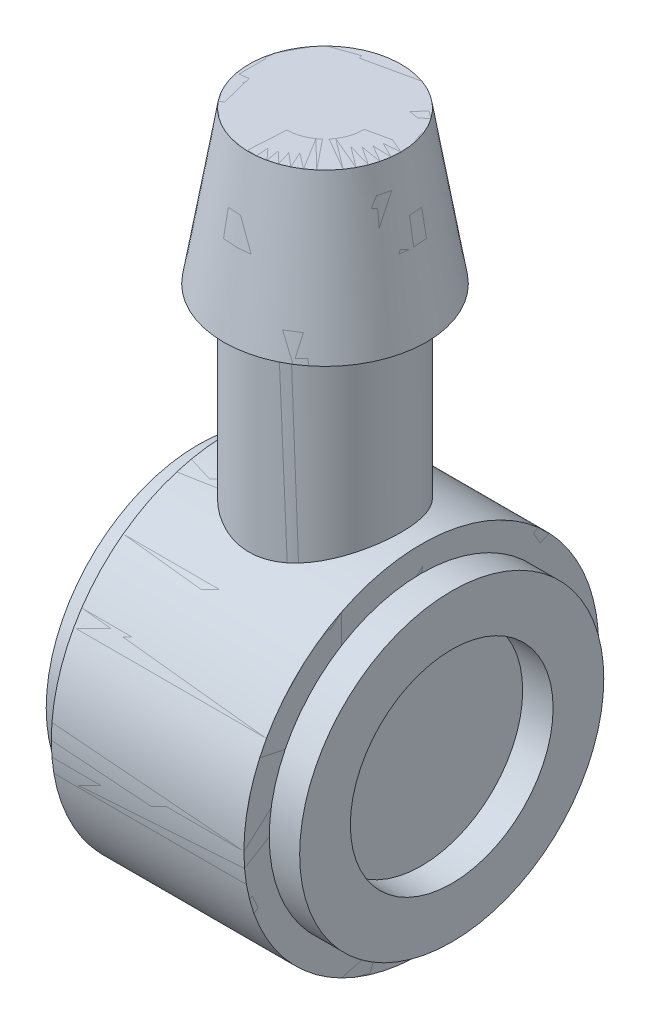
ISO-10303-21;
HEADER;
FILE_DESCRIPTION(('STEP AP214'),'2;1');
FILE_NAME('part.step','',(''),(''),'','','');
FILE_SCHEMA(('AUTOMOTIVE_DESIGN { 1 0 10303 214 1 1 1 1 }'));
ENDSEC;
DATA;
#1=APPLICATION_CONTEXT('core data for automotive mechanical design processes');
#2=APPLICATION_PROTOCOL_DEFINITION('international standard','automotive_design',2000,#1);
#3=PRODUCT_CONTEXT('',#1,'mechanical');
#4=PRODUCT('Part','Part','',(#3));
#5=PRODUCT_RELATED_PRODUCT_CATEGORY('part','',(#4));
#6=PRODUCT_DEFINITION_FORMATION('','',#4);
#7=PRODUCT_DEFINITION_CONTEXT('part definition',#1,'design');
#8=PRODUCT_DEFINITION('design','',#6,#7);
#9=PRODUCT_DEFINITION_SHAPE('','',#8);
#10=(LENGTH_UNIT() NAMED_UNIT(*) SI_UNIT(.MILLI.,.METRE.));
#11=(NAMED_UNIT(*) PLANE_ANGLE_UNIT() SI_UNIT($,.RADIAN.));
#12=(NAMED_UNIT(*) SI_UNIT($,.STERADIAN.) SOLID_ANGLE_UNIT());
#13=UNCERTAINTY_MEASURE_WITH_UNIT(LENGTH_MEASURE(1.E-05),#10,'distance_accuracy_value','');
#14=(GEOMETRIC_REPRESENTATION_CONTEXT(3) GLOBAL_UNCERTAINTY_ASSIGNED_CONTEXT((#13)) GLOBAL_UNIT_ASSIGNED_CONTEXT((#10,
#11,#12)) REPRESENTATION_CONTEXT('',''));
#15=CARTESIAN_POINT('',(0.,0.,0.));
#16=DIRECTION('',(0.,0.,1.));
#17=DIRECTION('',(1.,0.,0.));
#18=AXIS2_PLACEMENT_3D('',#15,#16,#17);
#19=CARTESIAN_POINT('',(-1.9,-4.888807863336,0.77431109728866));
#20=DIRECTION('',(-1.,0.,0.));
#21=DIRECTION('',(0.,0.809016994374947,0.587785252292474));
#22=AXIS2_PLACEMENT_3D('',#19,#20,#21);
#23=PLANE('',#22);
#24=CARTESIAN_POINT('',(-1.9,0.,0.));
#25=DIRECTION('',(-1.,0.,0.));
#26=DIRECTION('',(0.,0.,1.));
#27=AXIS2_PLACEMENT_3D('',#24,#25,#26);
#28=CIRCLE('',#27,3.50000000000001);
#29=CARTESIAN_POINT('',(-1.9,0.,3.50000000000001));
#30=VERTEX_POINT('',#29);
#31=EDGE_CURVE('P0_E364',#30,#30,#28,.T.);
#32=ORIENTED_EDGE('',*,*,#31,.T.);
#33=EDGE_LOOP('',(#32));
#34=FACE_BOUND('',#33,.T.);
#35=CARTESIAN_POINT('',(-1.9,0.,0.));
#36=DIRECTION('',(-1.,0.,0.));
#37=DIRECTION('',(0.,0.,1.));
#38=AXIS2_PLACEMENT_3D('',#35,#36,#37);
#39=CIRCLE('',#38,2.99999999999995);
#40=CARTESIAN_POINT('',(-1.9,0.,2.99999999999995));
#41=VERTEX_POINT('',#40);
#42=EDGE_CURVE('P0_E470',#41,#41,#39,.T.);
#43=ORIENTED_EDGE('',*,*,#42,.F.);
#44=EDGE_LOOP('',(#43));
#45=FACE_BOUND('',#44,.T.);
#46=ADVANCED_FACE('P0_F348',(#34,#45),#23,.T.);
#47=CARTESIAN_POINT('',(1.9,-0.77431109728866,-4.888807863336));
#48=DIRECTION('',(1.,0.,0.));
#49=DIRECTION('',(0.,0.809016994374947,0.587785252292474));
#50=AXIS2_PLACEMENT_3D('',#47,#48,#49);
#51=PLANE('',#50);
#52=CARTESIAN_POINT('',(1.9,0.,0.));
#53=DIRECTION('',(-1.,0.,0.));
#54=DIRECTION('',(0.,0.,1.));
#55=AXIS2_PLACEMENT_3D('',#52,#53,#54);
#56=CIRCLE('',#55,3.50000000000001);
#57=CARTESIAN_POINT('',(1.9,0.,3.50000000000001));
#58=VERTEX_POINT('',#57);
#59=EDGE_CURVE('P0_E359',#58,#58,#56,.F.);
#60=ORIENTED_EDGE('',*,*,#59,.T.);
#61=EDGE_LOOP('',(#60));
#62=FACE_BOUND('',#61,.T.);
#63=CARTESIAN_POINT('',(1.9,0.,0.));
#64=DIRECTION('',(1.,0.,0.));
#65=DIRECTION('',(0.,0.,-1.));
#66=AXIS2_PLACEMENT_3D('',#63,#64,#65);
#67=CIRCLE('',#66,2.99999999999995);
#68=CARTESIAN_POINT('',(1.9,0.,-2.99999999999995));
#69=VERTEX_POINT('',#68);
#70=EDGE_CURVE('P0_E458',#69,#69,#67,.T.);
#71=ORIENTED_EDGE('',*,*,#70,.F.);
#72=EDGE_LOOP('',(#71));
#73=FACE_BOUND('',#72,.T.);
#74=ADVANCED_FACE('P0_F350',(#62,#73),#51,.T.);
#75=CARTESIAN_POINT('',(1.5,10.,1.5));
#76=DIRECTION('',(0.,1.,0.));
#77=DIRECTION('',(0.,0.,-1.));
#78=AXIS2_PLACEMENT_3D('',#75,#76,#77);
#79=PLANE('',#78);
#80=CARTESIAN_POINT('',(0.,10.,0.));
#81=DIRECTION('',(0.,1.,0.));
#82=DIRECTION('',(0.,0.,1.));
#83=AXIS2_PLACEMENT_3D('',#80,#81,#82);
#84=CIRCLE('',#83,0.75);
#85=CARTESIAN_POINT('',(0.,10.,0.75));
#86=VERTEX_POINT('',#85);
#87=EDGE_CURVE('P0_E445',#86,#86,#84,.T.);
#88=ORIENTED_EDGE('',*,*,#87,.F.);
#89=EDGE_LOOP('',(#88));
#90=FACE_BOUND('',#89,.T.);
#91=CARTESIAN_POINT('',(0.,10.,0.));
#92=DIRECTION('',(0.,-1.,0.));
#93=DIRECTION('',(1.,0.,0.));
#94=AXIS2_PLACEMENT_3D('',#91,#92,#93);
#95=CIRCLE('',#94,1.5);
#96=CARTESIAN_POINT('',(1.5,10.,0.));
#97=VERTEX_POINT('',#96);
#98=EDGE_CURVE('P0_E448',#97,#97,#95,.F.);
#99=ORIENTED_EDGE('',*,*,#98,.T.);
#100=EDGE_LOOP('',(#99));
#101=FACE_BOUND('',#100,.T.);
#102=ADVANCED_FACE('P0_F402',(#90,#101),#79,.T.);
#103=CARTESIAN_POINT('',(0.,10.,0.));
#104=DIRECTION('',(0.,-1.,0.));
#105=DIRECTION('',(1.,0.,0.));
#106=AXIS2_PLACEMENT_3D('',#103,#104,#105);
#107=CONICAL_SURFACE('',#106,1.5,0.165148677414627);
#108=ORIENTED_EDGE('',*,*,#98,.F.);
#109=EDGE_LOOP('',(#108));
#110=FACE_BOUND('',#109,.T.);
#111=CARTESIAN_POINT('',(0.,7.,0.));
#112=DIRECTION('',(0.,-1.,0.));
#113=DIRECTION('',(1.,0.,0.));
#114=AXIS2_PLACEMENT_3D('',#111,#112,#113);
#115=CIRCLE('',#114,2.);
#116=CARTESIAN_POINT('',(2.,7.,0.));
#117=VERTEX_POINT('',#116);
#118=EDGE_CURVE('P0_E450',#117,#117,#115,.T.);
#119=ORIENTED_EDGE('',*,*,#118,.F.);
#120=EDGE_LOOP('',(#119));
#121=FACE_BOUND('',#120,.T.);
#122=ADVANCED_FACE('P0_F399',(#110,#121),#107,.T.);
#123=CARTESIAN_POINT('',(-2.,7.,2.));
#124=DIRECTION('',(0.,-1.,0.));
#125=DIRECTION('',(0.,0.,-1.));
#126=AXIS2_PLACEMENT_3D('',#123,#124,#125);
#127=PLANE('',#126);
#128=CARTESIAN_POINT('',(0.,7.,0.));
#129=DIRECTION('',(0.,-1.,0.));
#130=DIRECTION('',(1.,0.,0.));
#131=AXIS2_PLACEMENT_3D('',#128,#129,#130);
#132=CIRCLE('',#131,1.5);
#133=CARTESIAN_POINT('',(1.5,7.,0.));
#134=VERTEX_POINT('',#133);
#135=EDGE_CURVE('P0_E388',#134,#134,#132,.F.);
#136=ORIENTED_EDGE('',*,*,#135,.T.);
#137=EDGE_LOOP('',(#136));
#138=FACE_BOUND('',#137,.T.);
#139=ORIENTED_EDGE('',*,*,#118,.T.);
#140=EDGE_LOOP('',(#139));
#141=FACE_BOUND('',#140,.T.);
#142=ADVANCED_FACE('P0_F397',(#138,#141),#127,.T.);
#143=CARTESIAN_POINT('',(0.,7.,0.));
#144=DIRECTION('',(0.,-1.,0.));
#145=DIRECTION('',(1.,0.,0.));
#146=AXIS2_PLACEMENT_3D('',#143,#144,#145);
#147=CYLINDRICAL_SURFACE('',#146,1.5);
#148=ORIENTED_EDGE('',*,*,#135,.F.);
#149=EDGE_LOOP('',(#148));
#150=FACE_BOUND('',#149,.T.);
#151=CARTESIAN_POINT('',(-0.195789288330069,3.1683329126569,-1.48716729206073));
#152=CARTESIAN_POINT('',(-0.2608291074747,3.17235162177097,-1.47860501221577));
#153=CARTESIAN_POINT('',(-0.325181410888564,3.17833785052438,-1.46578159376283));
#154=CARTESIAN_POINT('',(-0.45165434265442,3.19374764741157,-1.43189443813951));
#155=CARTESIAN_POINT('',(-0.513759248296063,3.20319164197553,-1.41078167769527));
#156=CARTESIAN_POINT('',(-0.634687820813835,3.22478863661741,-1.36069257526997));
#157=CARTESIAN_POINT('',(-0.693487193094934,3.23695906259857,-1.3316653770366));
#158=CARTESIAN_POINT('',(-0.806811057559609,3.26310976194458,-1.26623864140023));
#159=CARTESIAN_POINT('',(-0.861311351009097,3.27709924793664,-1.22980100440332));
#160=CARTESIAN_POINT('',(-0.9651081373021,3.30589460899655,-1.15015527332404));
#161=CARTESIAN_POINT('',(-1.01439068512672,3.32070251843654,-1.10692976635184));
#162=CARTESIAN_POINT('',(-1.10690110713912,3.35012043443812,-1.01441912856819));
#163=CARTESIAN_POINT('',(-1.1501326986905,3.3647305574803,-0.965137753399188));
#164=CARTESIAN_POINT('',(-1.22978509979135,3.39278442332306,-0.861331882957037));
#165=CARTESIAN_POINT('',(-1.26622963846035,3.40623213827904,-0.806826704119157));
#166=CARTESIAN_POINT('',(-1.33166459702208,3.43109588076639,-0.693488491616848));
#167=CARTESIAN_POINT('',(-1.36069524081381,3.44252276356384,-0.634681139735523));
#168=CARTESIAN_POINT('',(-1.41078940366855,3.46262945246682,-0.51374083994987));
#169=CARTESIAN_POINT('',(-1.43190065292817,3.47132566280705,-0.451630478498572));
#170=CARTESIAN_POINT('',(-1.46578863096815,3.48544105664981,-0.325155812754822));
#171=CARTESIAN_POINT('',(-1.47860806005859,3.49087701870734,-0.260804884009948));
#172=CARTESIAN_POINT('',(-1.49570111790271,3.49815117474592,-0.130966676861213));
#173=CARTESIAN_POINT('',(-1.5,3.50000000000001,-0.0654833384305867));
#174=CARTESIAN_POINT('',(-1.5,3.50000000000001,0.0654833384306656));
#175=CARTESIAN_POINT('',(-1.49570111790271,3.49815117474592,0.130966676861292));
#176=CARTESIAN_POINT('',(-1.47860806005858,3.49087701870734,0.260804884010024));
#177=CARTESIAN_POINT('',(-1.46578863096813,3.4854410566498,0.325155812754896));
#178=CARTESIAN_POINT('',(-1.43190065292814,3.47132566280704,0.451630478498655));
#179=CARTESIAN_POINT('',(-1.41078940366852,3.46262945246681,0.513740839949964));
#180=CARTESIAN_POINT('',(-1.36069524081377,3.44252276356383,0.634681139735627));
#181=CARTESIAN_POINT('',(-1.33166459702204,3.43109588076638,0.69348849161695));
#182=CARTESIAN_POINT('',(-1.26622963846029,3.40623213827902,0.806826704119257));
#183=CARTESIAN_POINT('',(-1.22978509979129,3.39278442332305,0.861331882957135));
#184=CARTESIAN_POINT('',(-1.15013269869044,3.36473055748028,0.965137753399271));
#185=CARTESIAN_POINT('',(-1.10690110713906,3.3501204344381,1.01441912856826));
#186=CARTESIAN_POINT('',(-1.01439068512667,3.32070251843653,1.10692976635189));
#187=CARTESIAN_POINT('',(-0.965108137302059,3.30589460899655,1.15015527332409));
#188=CARTESIAN_POINT('',(-0.861311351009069,3.27709924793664,1.22980100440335));
#189=CARTESIAN_POINT('',(-0.806811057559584,3.26310976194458,1.26623864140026));
#190=CARTESIAN_POINT('',(-0.693487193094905,3.23695906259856,1.33166537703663));
#191=CARTESIAN_POINT('',(-0.634687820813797,3.22478863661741,1.36069257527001));
#192=CARTESIAN_POINT('',(-0.513759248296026,3.20319164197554,1.41078167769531));
#193=CARTESIAN_POINT('',(-0.451654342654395,3.19374764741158,1.43189443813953));
#194=CARTESIAN_POINT('',(-0.325181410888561,3.17833785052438,1.46578159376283));
#195=CARTESIAN_POINT('',(-0.260829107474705,3.17235162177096,1.47860501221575));
#196=CARTESIAN_POINT('',(-0.13098127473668,3.16432852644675,1.49569905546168));
#197=CARTESIAN_POINT('',(-0.0654906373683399,3.1622776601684,1.50000000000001));
#198=CARTESIAN_POINT('',(0.0654906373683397,3.1622776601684,1.50000000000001));
#199=CARTESIAN_POINT('',(0.13098127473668,3.16432852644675,1.49569905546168));
#200=CARTESIAN_POINT('',(0.260829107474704,3.17235162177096,1.47860501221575));
#201=CARTESIAN_POINT('',(0.325181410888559,3.17833785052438,1.46578159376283));
#202=CARTESIAN_POINT('',(0.451654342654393,3.19374764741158,1.43189443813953));
#203=CARTESIAN_POINT('',(0.513759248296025,3.20319164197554,1.41078167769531));
#204=CARTESIAN_POINT('',(0.634687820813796,3.22478863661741,1.36069257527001));
#205=CARTESIAN_POINT('',(0.693487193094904,3.23695906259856,1.33166537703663));
#206=CARTESIAN_POINT('',(0.806811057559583,3.26310976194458,1.26623864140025));
#207=CARTESIAN_POINT('',(0.861311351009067,3.27709924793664,1.22980100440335));
#208=CARTESIAN_POINT('',(0.965108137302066,3.30589460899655,1.15015527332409));
#209=CARTESIAN_POINT('',(1.01439068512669,3.32070251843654,1.10692976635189));
#210=CARTESIAN_POINT('',(1.10690110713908,3.35012043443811,1.01441912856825));
#211=CARTESIAN_POINT('',(1.15013269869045,3.36473055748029,0.965137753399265));
#212=CARTESIAN_POINT('',(1.22978509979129,3.39278442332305,0.861331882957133));
#213=CARTESIAN_POINT('',(1.26622963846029,3.40623213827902,0.806826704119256));
#214=CARTESIAN_POINT('',(1.33166459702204,3.43109588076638,0.69348849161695));
#215=CARTESIAN_POINT('',(1.36069524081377,3.44252276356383,0.634681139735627));
#216=CARTESIAN_POINT('',(1.41078940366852,3.46262945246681,0.513740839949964));
#217=CARTESIAN_POINT('',(1.43190065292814,3.47132566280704,0.451630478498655));
#218=CARTESIAN_POINT('',(1.46578863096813,3.4854410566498,0.325155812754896));
#219=CARTESIAN_POINT('',(1.47860806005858,3.49087701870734,0.260804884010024));
#220=CARTESIAN_POINT('',(1.4957011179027,3.49815117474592,0.130966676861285));
#221=CARTESIAN_POINT('',(1.5,3.50000000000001,0.0654833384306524));
#222=CARTESIAN_POINT('',(1.5,3.50000000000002,-0.0654833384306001));
#223=CARTESIAN_POINT('',(1.49570111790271,3.49815117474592,-0.13096667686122));
#224=CARTESIAN_POINT('',(1.47860806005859,3.49087701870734,-0.260804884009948));
#225=CARTESIAN_POINT('',(1.46578863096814,3.48544105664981,-0.325155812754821));
#226=CARTESIAN_POINT('',(1.43190065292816,3.47132566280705,-0.451630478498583));
#227=CARTESIAN_POINT('',(1.41078940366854,3.46262945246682,-0.513740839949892));
#228=CARTESIAN_POINT('',(1.3606952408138,3.44252276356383,-0.634681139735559));
#229=CARTESIAN_POINT('',(1.33166459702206,3.43109588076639,-0.693488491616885));
#230=CARTESIAN_POINT('',(1.26622963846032,3.40623213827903,-0.806826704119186));
#231=CARTESIAN_POINT('',(1.22978509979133,3.39278442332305,-0.861331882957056));
#232=CARTESIAN_POINT('',(1.15013269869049,3.36473055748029,-0.965137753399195));
#233=CARTESIAN_POINT('',(1.10690110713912,3.35012043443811,-1.01441912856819));
#234=CARTESIAN_POINT('',(1.01439068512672,3.32070251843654,-1.10692976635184));
#235=CARTESIAN_POINT('',(0.965108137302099,3.30589460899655,-1.15015527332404));
#236=CARTESIAN_POINT('',(0.861311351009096,3.27709924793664,-1.22980100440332));
#237=CARTESIAN_POINT('',(0.806811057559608,3.26310976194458,-1.26623864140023));
#238=CARTESIAN_POINT('',(0.693487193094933,3.23695906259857,-1.3316653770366));
#239=CARTESIAN_POINT('',(0.634687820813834,3.22478863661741,-1.36069257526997));
#240=CARTESIAN_POINT('',(0.513759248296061,3.20319164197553,-1.41078167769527));
#241=CARTESIAN_POINT('',(0.451654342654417,3.19374764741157,-1.43189443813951));
#242=CARTESIAN_POINT('',(0.325181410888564,3.17833785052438,-1.46578159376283));
#243=CARTESIAN_POINT('',(0.260829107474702,3.17235162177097,-1.47860501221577));
#244=CARTESIAN_POINT('',(0.130981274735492,3.16432852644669,-1.49569905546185));
#245=CARTESIAN_POINT('',(0.06549063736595,3.16227766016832,-1.50000000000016));
#246=CARTESIAN_POINT('',(-0.0654906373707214,3.16227766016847,-1.49999999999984));
#247=CARTESIAN_POINT('',(-0.130981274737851,3.16432852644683,-1.49569905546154));
#248=CARTESIAN_POINT('',(-0.195789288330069,3.1683329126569,-1.48716729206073));
#249=B_SPLINE_CURVE_WITH_KNOTS('',3,(#151,#152,#153,#154,#155,#156,#157,#158,#159,#160,#161,
#162,#163,#164,#165,#166,#167,#168,#169,#170,#171,#172,#173,#174,#175,#176,#177,#178,#179,#180,
#181,#182,#183,#184,#185,#186,#187,#188,#189,#190,#191,#192,#193,#194,#195,#196,#197,#198,#199,
#200,#201,#202,#203,#204,#205,#206,#207,#208,#209,#210,#211,#212,#213,#214,#215,#216,#217,#218,
#219,#220,#221,#222,#223,#224,#225,#226,#227,#228,#229,#230,#231,#232,#233,#234,#235,#236,#237,
#238,#239,#240,#241,#242,#243,#244,#245,#246,#247,#248),.UNSPECIFIED.,.T.,.F.,(4,2,2,2,2,2,2,2,
2,2,2,2,2,2,2,2,2,2,2,2,2,2,2,2,2,2,2,2,2,2,2,2,2,2,2,2,2,2,2,2,2,2,2,2,2,2,2,2,4),(0.,
0.197004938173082,0.395192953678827,0.594685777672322,0.795231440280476,0.996300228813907,
1.19724494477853,1.39747335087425,1.59659116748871,1.79448884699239,1.99135912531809,
2.18764503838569,2.38393095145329,2.58080122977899,2.77869890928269,2.97781672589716,
3.17804513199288,3.37898984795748,3.58005863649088,3.78060429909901,3.98009712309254,
4.17828513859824,4.37529007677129,4.57159287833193,4.76789567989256,4.96490061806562,
5.16308863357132,5.36258145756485,5.56312712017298,5.76419590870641,5.96514062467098,
6.16536903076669,6.36448684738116,6.56238452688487,6.75925480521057,6.95554071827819,
7.15182663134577,7.34869690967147,7.54659458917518,7.74571240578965,7.94594081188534,
8.14688552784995,8.34795431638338,8.54849997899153,8.74799280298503,8.94618081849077,
9.14318575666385,9.33948855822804,9.5357913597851),.UNSPECIFIED.);
#250=CARTESIAN_POINT('',(-0.195789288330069,3.1683329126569,-1.48716729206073));
#251=VERTEX_POINT('',#250);
#252=EDGE_CURVE('P0_E372',#251,#251,#249,.T.);
#253=ORIENTED_EDGE('',*,*,#252,.T.);
#254=EDGE_LOOP('',(#253));
#255=FACE_BOUND('',#254,.T.);
#256=ADVANCED_FACE('P0_F393',(#150,#255),#147,.T.);
#257=CARTESIAN_POINT('',(1.9,0.,0.));
#258=DIRECTION('',(-1.,0.,0.));
#259=DIRECTION('',(0.,0.,1.));
#260=AXIS2_PLACEMENT_3D('',#257,#258,#259);
#261=CYLINDRICAL_SURFACE('',#260,3.50000000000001);
#262=ORIENTED_EDGE('',*,*,#59,.F.);
#263=EDGE_LOOP('',(#262));
#264=FACE_BOUND('',#263,.T.);
#265=ORIENTED_EDGE('',*,*,#252,.F.);
#266=EDGE_LOOP('',(#265));
#267=FACE_BOUND('',#266,.T.);
#268=ORIENTED_EDGE('',*,*,#31,.F.);
#269=EDGE_LOOP('',(#268));
#270=FACE_BOUND('',#269,.T.);
#271=ADVANCED_FACE('P0_F390',(#264,#267,#270),#261,.T.);
#272=CARTESIAN_POINT('',(2.5,0.,0.));
#273=DIRECTION('',(-1.,0.,0.));
#274=DIRECTION('',(0.,0.,1.));
#275=AXIS2_PLACEMENT_3D('',#272,#273,#274);
#276=CYLINDRICAL_SURFACE('',#275,2.99999999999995);
#277=CARTESIAN_POINT('',(2.5,0.,0.));
#278=DIRECTION('',(1.,0.,0.));
#279=DIRECTION('',(0.,0.,-1.));
#280=AXIS2_PLACEMENT_3D('',#277,#278,#279);
#281=CIRCLE('',#280,2.99999999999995);
#282=CARTESIAN_POINT('',(2.5,0.,-2.99999999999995));
#283=VERTEX_POINT('',#282);
#284=EDGE_CURVE('P0_E376',#283,#283,#281,.T.);
#285=ORIENTED_EDGE('',*,*,#284,.F.);
#286=EDGE_LOOP('',(#285));
#287=FACE_BOUND('',#286,.T.);
#288=ORIENTED_EDGE('',*,*,#70,.T.);
#289=EDGE_LOOP('',(#288));
#290=FACE_BOUND('',#289,.T.);
#291=ADVANCED_FACE('P0_F404',(#287,#290),#276,.T.);
#292=CARTESIAN_POINT('',(2.5,0.,0.));
#293=DIRECTION('',(1.,0.,0.));
#294=DIRECTION('',(0.,0.,-1.));
#295=AXIS2_PLACEMENT_3D('',#292,#293,#294);
#296=PLANE('',#295);
#297=CARTESIAN_POINT('',(2.5,0.,0.));
#298=DIRECTION('',(1.,0.,0.));
#299=DIRECTION('',(0.,0.,-1.));
#300=AXIS2_PLACEMENT_3D('',#297,#298,#299);
#301=CIRCLE('',#300,1.99999999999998);
#302=CARTESIAN_POINT('',(2.5,0.,-1.99999999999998));
#303=VERTEX_POINT('',#302);
#304=EDGE_CURVE('P0_E478',#303,#303,#301,.T.);
#305=ORIENTED_EDGE('',*,*,#304,.F.);
#306=EDGE_LOOP('',(#305));
#307=FACE_BOUND('',#306,.T.);
#308=ORIENTED_EDGE('',*,*,#284,.T.);
#309=EDGE_LOOP('',(#308));
#310=FACE_BOUND('',#309,.T.);
#311=ADVANCED_FACE('P0_F407',(#307,#310),#296,.T.);
#312=CARTESIAN_POINT('',(-2.5,0.,0.));
#313=DIRECTION('',(1.,0.,0.));
#314=DIRECTION('',(0.,0.,-1.));
#315=AXIS2_PLACEMENT_3D('',#312,#313,#314);
#316=CYLINDRICAL_SURFACE('',#315,2.99999999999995);
#317=CARTESIAN_POINT('',(-2.5,0.,0.));
#318=DIRECTION('',(-1.,0.,0.));
#319=DIRECTION('',(0.,0.,1.));
#320=AXIS2_PLACEMENT_3D('',#317,#318,#319);
#321=CIRCLE('',#320,2.99999999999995);
#322=CARTESIAN_POINT('',(-2.5,0.,2.99999999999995));
#323=VERTEX_POINT('',#322);
#324=EDGE_CURVE('P0_E466',#323,#323,#321,.T.);
#325=ORIENTED_EDGE('',*,*,#324,.F.);
#326=EDGE_LOOP('',(#325));
#327=FACE_BOUND('',#326,.T.);
#328=ORIENTED_EDGE('',*,*,#42,.T.);
#329=EDGE_LOOP('',(#328));
#330=FACE_BOUND('',#329,.T.);
#331=ADVANCED_FACE('P0_F411',(#327,#330),#316,.T.);
#332=CARTESIAN_POINT('',(-2.5,0.,0.));
#333=DIRECTION('',(-1.,0.,0.));
#334=DIRECTION('',(0.,0.,1.));
#335=AXIS2_PLACEMENT_3D('',#332,#333,#334);
#336=PLANE('',#335);
#337=CARTESIAN_POINT('',(-2.5,0.,0.));
#338=DIRECTION('',(1.,0.,0.));
#339=DIRECTION('',(0.,0.,-1.));
#340=AXIS2_PLACEMENT_3D('',#337,#338,#339);
#341=CIRCLE('',#340,1.99999999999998);
#342=CARTESIAN_POINT('',(-2.5,0.,-1.99999999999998));
#343=VERTEX_POINT('',#342);
#344=EDGE_CURVE('P0_E475',#343,#343,#341,.T.);
#345=ORIENTED_EDGE('',*,*,#344,.T.);
#346=EDGE_LOOP('',(#345));
#347=FACE_BOUND('',#346,.T.);
#348=ORIENTED_EDGE('',*,*,#324,.T.);
#349=EDGE_LOOP('',(#348));
#350=FACE_BOUND('',#349,.T.);
#351=ADVANCED_FACE('P0_F415',(#347,#350),#336,.T.);
#352=CARTESIAN_POINT('',(-2.5,0.,0.));
#353=DIRECTION('',(1.,0.,0.));
#354=DIRECTION('',(0.,0.,-1.));
#355=AXIS2_PLACEMENT_3D('',#352,#353,#354);
#356=CYLINDRICAL_SURFACE('',#355,1.99999999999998);
#357=CARTESIAN_POINT('',(0.,1.85404962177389,0.75));
#358=CARTESIAN_POINT('',(0.0405037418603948,1.85404820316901,0.750001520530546));
#359=CARTESIAN_POINT('',(0.0809974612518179,1.8553913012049,0.746707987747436));
#360=CARTESIAN_POINT('',(0.160764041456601,1.86058079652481,0.733680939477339));
#361=CARTESIAN_POINT('',(0.200036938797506,1.86442711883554,0.723947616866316));
#362=CARTESIAN_POINT('',(0.276187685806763,1.87412740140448,0.698448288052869));
#363=CARTESIAN_POINT('',(0.313071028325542,1.87997654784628,0.682696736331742));
#364=CARTESIAN_POINT('',(0.38368594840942,1.89301567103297,0.645659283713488));
#365=CARTESIAN_POINT('',(0.41741657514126,1.90020605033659,0.624371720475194));
#366=CARTESIAN_POINT('',(0.482445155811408,1.91551787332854,0.575733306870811));
#367=CARTESIAN_POINT('',(0.513564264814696,1.92366670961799,0.548151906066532));
#368=CARTESIAN_POINT('',(0.570861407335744,1.93974875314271,0.488197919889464));
#369=CARTESIAN_POINT('',(0.597038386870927,1.9476819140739,0.45582431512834));
#370=CARTESIAN_POINT('',(0.644569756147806,1.96276436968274,0.385847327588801));
#371=CARTESIAN_POINT('',(0.665729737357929,1.9698778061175,0.348103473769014));
#372=CARTESIAN_POINT('',(0.701325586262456,1.98219003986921,0.269277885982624));
#373=CARTESIAN_POINT('',(0.715763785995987,1.98738950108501,0.228197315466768));
#374=CARTESIAN_POINT('',(0.736878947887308,1.99509348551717,0.145744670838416));
#375=CARTESIAN_POINT('',(0.743863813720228,1.99770457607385,0.104461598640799));
#376=CARTESIAN_POINT('',(0.750860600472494,2.00032007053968,0.0212321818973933));
#377=CARTESIAN_POINT('',(0.750874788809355,2.00032532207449,-0.0207139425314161));
#378=CARTESIAN_POINT('',(0.744109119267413,1.99779632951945,-0.101871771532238));
#379=CARTESIAN_POINT('',(0.737665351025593,1.99538770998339,-0.14111608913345));
#380=CARTESIAN_POINT('',(0.718732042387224,1.98846637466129,-0.217919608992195));
#381=CARTESIAN_POINT('',(0.706242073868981,1.98395350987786,-0.255478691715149));
#382=CARTESIAN_POINT('',(0.675414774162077,1.97318884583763,-0.328494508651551));
#383=CARTESIAN_POINT('',(0.656994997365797,1.96691269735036,-0.363912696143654));
#384=CARTESIAN_POINT('',(0.614903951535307,1.95325655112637,-0.431243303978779));
#385=CARTESIAN_POINT('',(0.5912309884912,1.94587619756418,-0.463154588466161));
#386=CARTESIAN_POINT('',(0.537686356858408,1.93026264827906,-0.524545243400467));
#387=CARTESIAN_POINT('',(0.507533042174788,1.92200481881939,-0.55377307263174));
#388=CARTESIAN_POINT('',(0.442703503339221,1.90591230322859,-0.606851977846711));
#389=CARTESIAN_POINT('',(0.408026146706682,1.89807772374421,-0.630701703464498));
#390=CARTESIAN_POINT('',(0.33414026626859,1.88356351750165,-0.672828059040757));
#391=CARTESIAN_POINT('',(0.294848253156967,1.87691338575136,-0.690969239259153));
#392=CARTESIAN_POINT('',(0.213451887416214,1.86586219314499,-0.720282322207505));
#393=CARTESIAN_POINT('',(0.171349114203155,1.86145988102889,-0.731458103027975));
#394=CARTESIAN_POINT('',(0.0880120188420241,1.85569798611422,-0.745950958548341));
#395=CARTESIAN_POINT('',(0.0468579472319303,1.85418392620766,-0.749667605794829));
#396=CARTESIAN_POINT('',(-0.0355046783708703,1.85393269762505,-0.750289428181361));
#397=CARTESIAN_POINT('',(-0.0767132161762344,1.85519483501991,-0.747196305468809));
#398=CARTESIAN_POINT('',(-0.155964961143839,1.86019690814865,-0.734648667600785));
#399=CARTESIAN_POINT('',(-0.194065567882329,1.86381638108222,-0.725503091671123));
#400=CARTESIAN_POINT('',(-0.268173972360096,1.87298243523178,-0.701498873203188));
#401=CARTESIAN_POINT('',(-0.304181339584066,1.87852941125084,-0.686639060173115));
#402=CARTESIAN_POINT('',(-0.374582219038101,1.89118121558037,-0.65100146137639));
#403=CARTESIAN_POINT('',(-0.408864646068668,1.8983366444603,-0.630022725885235));
#404=CARTESIAN_POINT('',(-0.473564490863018,1.91331407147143,-0.582956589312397));
#405=CARTESIAN_POINT('',(-0.503980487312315,1.92113631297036,-0.556867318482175));
#406=CARTESIAN_POINT('',(-0.562084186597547,1.9371652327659,-0.498363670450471));
#407=CARTESIAN_POINT('',(-0.589476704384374,1.94536484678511,-0.465653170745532));
#408=CARTESIAN_POINT('',(-0.638419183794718,1.96074937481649,-0.395898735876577));
#409=CARTESIAN_POINT('',(-0.659969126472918,1.9679342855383,-0.358854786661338));
#410=CARTESIAN_POINT('',(-0.696473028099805,1.98047492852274,-0.28150816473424));
#411=CARTESIAN_POINT('',(-0.711449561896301,1.98583690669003,-0.241217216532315));
#412=CARTESIAN_POINT('',(-0.734328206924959,1.99414718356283,-0.158440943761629));
#413=CARTESIAN_POINT('',(-0.7422336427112,1.99709661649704,-0.115956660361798));
#414=CARTESIAN_POINT('',(-0.750387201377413,2.00014203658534,-0.0326677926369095));
#415=CARTESIAN_POINT('',(-0.751054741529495,2.0003943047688,0.00809038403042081));
#416=CARTESIAN_POINT('',(-0.745792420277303,1.99842444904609,0.08911339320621));
#417=CARTESIAN_POINT('',(-0.739863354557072,1.99620262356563,0.129378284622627));
#418=CARTESIAN_POINT('',(-0.721870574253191,1.98960544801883,0.207274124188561));
#419=CARTESIAN_POINT('',(-0.709960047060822,1.98528395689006,0.244945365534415));
#420=CARTESIAN_POINT('',(-0.680494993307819,1.97493891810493,0.317757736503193));
#421=CARTESIAN_POINT('',(-0.662939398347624,1.96891504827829,0.352898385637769));
#422=CARTESIAN_POINT('',(-0.621843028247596,1.95545309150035,0.421270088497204));
#423=CARTESIAN_POINT('',(-0.598081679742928,1.94796620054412,0.454358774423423));
#424=CARTESIAN_POINT('',(-0.545596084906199,1.9324975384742,0.516208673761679));
#425=CARTESIAN_POINT('',(-0.516870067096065,1.92451559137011,0.544968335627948));
#426=CARTESIAN_POINT('',(-0.453467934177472,1.90844064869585,0.598906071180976));
#427=CARTESIAN_POINT('',(-0.418557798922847,1.90036402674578,0.623814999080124));
#428=CARTESIAN_POINT('',(-0.34479206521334,1.88549162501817,0.667423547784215));
#429=CARTESIAN_POINT('',(-0.305936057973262,1.87869597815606,0.686122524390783));
#430=CARTESIAN_POINT('',(-0.223522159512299,1.86701134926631,0.717329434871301));
#431=CARTESIAN_POINT('',(-0.17983281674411,1.86221901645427,0.729530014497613));
#432=CARTESIAN_POINT('',(-0.0907573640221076,1.85573997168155,0.745861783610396));
#433=CARTESIAN_POINT('',(-0.0453723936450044,1.85405121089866,0.749998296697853));
#434=CARTESIAN_POINT('',(0.,1.85404962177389,0.75));
#435=B_SPLINE_CURVE_WITH_KNOTS('',3,(#357,#358,#359,#360,#361,#362,#363,#364,#365,#366,#367,
#368,#369,#370,#371,#372,#373,#374,#375,#376,#377,#378,#379,#380,#381,#382,#383,#384,#385,#386,
#387,#388,#389,#390,#391,#392,#393,#394,#395,#396,#397,#398,#399,#400,#401,#402,#403,#404,#405,
#406,#407,#408,#409,#410,#411,#412,#413,#414,#415,#416,#417,#418,#419,#420,#421,#422,#423,#424,
#425,#426,#427,#428,#429,#430,#431,#432,#433,#434),.UNSPECIFIED.,.T.,.F.,(4,2,2,2,2,2,2,2,2,2,2,
2,2,2,2,2,2,2,2,2,2,2,2,2,2,2,2,2,2,2,2,2,2,2,2,2,2,2,4),(0.,0.121342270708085,
0.242680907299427,0.363729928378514,0.484815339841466,0.611373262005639,0.737958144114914,
0.868850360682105,0.99969713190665,1.12490009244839,1.25006232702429,1.36903236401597,
1.48801082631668,1.60872065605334,1.72946946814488,1.85728337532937,1.98512933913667,
2.11581296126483,2.24642375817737,2.36982828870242,2.49320197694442,2.61071922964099,
2.72826056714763,2.8502078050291,2.97219974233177,3.10192508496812,3.23165084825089,
3.36092754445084,3.49014342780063,3.61182860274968,3.7334991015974,3.85220137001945,
3.97092611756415,4.09464161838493,4.21840135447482,4.34869299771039,4.47899815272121,
4.61501589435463,4.75094381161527),.UNSPECIFIED.);
#436=CARTESIAN_POINT('',(0.,1.85404962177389,0.75));
#437=VERTEX_POINT('',#436);
#438=EDGE_CURVE('P0_E10',#437,#437,#435,.T.);
#439=ORIENTED_EDGE('',*,*,#438,.T.);
#440=EDGE_LOOP('',(#439));
#441=FACE_BOUND('',#440,.T.);
#442=ORIENTED_EDGE('',*,*,#344,.F.);
#443=EDGE_LOOP('',(#442));
#444=FACE_BOUND('',#443,.T.);
#445=ORIENTED_EDGE('',*,*,#304,.T.);
#446=EDGE_LOOP('',(#445));
#447=FACE_BOUND('',#446,.T.);
#448=ADVANCED_FACE('P0_F418',(#441,#444,#447),#356,.F.);
#449=CARTESIAN_POINT('',(0.,1.85404962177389,0.));
#450=DIRECTION('',(0.,1.,0.));
#451=DIRECTION('',(0.,0.,1.));
#452=AXIS2_PLACEMENT_3D('',#449,#450,#451);
#453=CYLINDRICAL_SURFACE('',#452,0.75);
#454=ORIENTED_EDGE('',*,*,#87,.T.);
#455=EDGE_LOOP('',(#454));
#456=FACE_BOUND('',#455,.T.);
#457=ORIENTED_EDGE('',*,*,#438,.F.);
#458=EDGE_LOOP('',(#457));
#459=FACE_BOUND('',#458,.T.);
#460=ADVANCED_FACE('P0_F422',(#456,#459),#453,.F.);
#461=CLOSED_SHELL('',(#46,#74,#102,#122,#142,#256,#271,#291,#311,#331,#351,#448,#460));
#462=MANIFOLD_SOLID_BREP('P0_B2',#461);
#463=CARTESIAN_POINT('',(1.5,10.,1.5));
#464=DIRECTION('',(0.,1.,0.));
#465=DIRECTION('',(0.,0.,-1.));
#466=AXIS2_PLACEMENT_3D('',#463,#464,#465);
#467=PLANE('',#466);
#468=CARTESIAN_POINT('',(0.,10.,0.));
#469=DIRECTION('',(0.,-1.,0.));
#470=DIRECTION('',(1.,0.,0.));
#471=AXIS2_PLACEMENT_3D('',#468,#469,#470);
#472=CIRCLE('',#471,1.5);
#473=CARTESIAN_POINT('',(1.5,10.,0.));
#474=VERTEX_POINT('',#473);
#475=EDGE_CURVE('P1_E85',#474,#474,#472,.F.);
#476=ORIENTED_EDGE('',*,*,#475,.T.);
#477=EDGE_LOOP('',(#476));
#478=FACE_BOUND('',#477,.T.);
#479=ADVANCED_FACE('P1_F13',(#478),#467,.T.);
#480=CARTESIAN_POINT('',(0.,10.,0.));
#481=DIRECTION('',(0.,-1.,0.));
#482=DIRECTION('',(1.,0.,0.));
#483=AXIS2_PLACEMENT_3D('',#480,#481,#482);
#484=CONICAL_SURFACE('',#483,1.5,0.165148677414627);
#485=ORIENTED_EDGE('',*,*,#475,.F.);
#486=EDGE_LOOP('',(#485));
#487=FACE_BOUND('',#486,.T.);
#488=CARTESIAN_POINT('',(0.,7.,0.));
#489=DIRECTION('',(0.,-1.,0.));
#490=DIRECTION('',(1.,0.,0.));
#491=AXIS2_PLACEMENT_3D('',#488,#489,#490);
#492=CIRCLE('',#491,2.);
#493=CARTESIAN_POINT('',(2.,7.,0.));
#494=VERTEX_POINT('',#493);
#495=EDGE_CURVE('P1_E89',#494,#494,#492,.T.);
#496=ORIENTED_EDGE('',*,*,#495,.F.);
#497=EDGE_LOOP('',(#496));
#498=FACE_BOUND('',#497,.T.);
#499=ADVANCED_FACE('P1_F55',(#487,#498),#484,.T.);
#500=CARTESIAN_POINT('',(-2.,7.,2.));
#501=DIRECTION('',(0.,-1.,0.));
#502=DIRECTION('',(0.,0.,-1.));
#503=AXIS2_PLACEMENT_3D('',#500,#501,#502);
#504=PLANE('',#503);
#505=CARTESIAN_POINT('',(0.,7.,0.));
#506=DIRECTION('',(0.,-1.,0.));
#507=DIRECTION('',(1.,0.,0.));
#508=AXIS2_PLACEMENT_3D('',#505,#506,#507);
#509=CIRCLE('',#508,1.5);
#510=CARTESIAN_POINT('',(1.5,7.,0.));
#511=VERTEX_POINT('',#510);
#512=EDGE_CURVE('P1_E44',#511,#511,#509,.F.);
#513=ORIENTED_EDGE('',*,*,#512,.T.);
#514=EDGE_LOOP('',(#513));
#515=FACE_BOUND('',#514,.T.);
#516=ORIENTED_EDGE('',*,*,#495,.T.);
#517=EDGE_LOOP('',(#516));
#518=FACE_BOUND('',#517,.T.);
#519=ADVANCED_FACE('P1_F53',(#515,#518),#504,.T.);
#520=CARTESIAN_POINT('',(0.,7.,0.));
#521=DIRECTION('',(0.,-1.,0.));
#522=DIRECTION('',(1.,0.,0.));
#523=AXIS2_PLACEMENT_3D('',#520,#521,#522);
#524=CYLINDRICAL_SURFACE('',#523,1.5);
#525=ORIENTED_EDGE('',*,*,#512,.F.);
#526=EDGE_LOOP('',(#525));
#527=FACE_BOUND('',#526,.T.);
#528=CARTESIAN_POINT('',(-0.195789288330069,3.1683329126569,-1.48716729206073));
#529=CARTESIAN_POINT('',(-0.2608291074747,3.17235162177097,-1.47860501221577));
#530=CARTESIAN_POINT('',(-0.325181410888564,3.17833785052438,-1.46578159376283));
#531=CARTESIAN_POINT('',(-0.45165434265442,3.19374764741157,-1.43189443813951));
#532=CARTESIAN_POINT('',(-0.513759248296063,3.20319164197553,-1.41078167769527));
#533=CARTESIAN_POINT('',(-0.634687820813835,3.22478863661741,-1.36069257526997));
#534=CARTESIAN_POINT('',(-0.693487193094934,3.23695906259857,-1.3316653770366));
#535=CARTESIAN_POINT('',(-0.806811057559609,3.26310976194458,-1.26623864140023));
#536=CARTESIAN_POINT('',(-0.861311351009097,3.27709924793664,-1.22980100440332));
#537=CARTESIAN_POINT('',(-0.9651081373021,3.30589460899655,-1.15015527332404));
#538=CARTESIAN_POINT('',(-1.01439068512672,3.32070251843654,-1.10692976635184));
#539=CARTESIAN_POINT('',(-1.10690110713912,3.35012043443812,-1.01441912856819));
#540=CARTESIAN_POINT('',(-1.1501326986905,3.3647305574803,-0.965137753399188));
#541=CARTESIAN_POINT('',(-1.22978509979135,3.39278442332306,-0.861331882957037));
#542=CARTESIAN_POINT('',(-1.26622963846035,3.40623213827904,-0.806826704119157));
#543=CARTESIAN_POINT('',(-1.33166459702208,3.43109588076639,-0.693488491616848));
#544=CARTESIAN_POINT('',(-1.36069524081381,3.44252276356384,-0.634681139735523));
#545=CARTESIAN_POINT('',(-1.41078940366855,3.46262945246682,-0.51374083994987));
#546=CARTESIAN_POINT('',(-1.43190065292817,3.47132566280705,-0.451630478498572));
#547=CARTESIAN_POINT('',(-1.46578863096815,3.48544105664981,-0.325155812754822));
#548=CARTESIAN_POINT('',(-1.47860806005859,3.49087701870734,-0.260804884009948));
#549=CARTESIAN_POINT('',(-1.49570111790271,3.49815117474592,-0.130966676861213));
#550=CARTESIAN_POINT('',(-1.5,3.50000000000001,-0.0654833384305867));
#551=CARTESIAN_POINT('',(-1.5,3.50000000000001,0.0654833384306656));
#552=CARTESIAN_POINT('',(-1.49570111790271,3.49815117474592,0.130966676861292));
#553=CARTESIAN_POINT('',(-1.47860806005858,3.49087701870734,0.260804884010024));
#554=CARTESIAN_POINT('',(-1.46578863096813,3.4854410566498,0.325155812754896));
#555=CARTESIAN_POINT('',(-1.43190065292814,3.47132566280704,0.451630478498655));
#556=CARTESIAN_POINT('',(-1.41078940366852,3.46262945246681,0.513740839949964));
#557=CARTESIAN_POINT('',(-1.36069524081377,3.44252276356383,0.634681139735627));
#558=CARTESIAN_POINT('',(-1.33166459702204,3.43109588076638,0.69348849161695));
#559=CARTESIAN_POINT('',(-1.26622963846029,3.40623213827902,0.806826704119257));
#560=CARTESIAN_POINT('',(-1.22978509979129,3.39278442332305,0.861331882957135));
#561=CARTESIAN_POINT('',(-1.15013269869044,3.36473055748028,0.965137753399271));
#562=CARTESIAN_POINT('',(-1.10690110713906,3.3501204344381,1.01441912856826));
#563=CARTESIAN_POINT('',(-1.01439068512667,3.32070251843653,1.10692976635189));
#564=CARTESIAN_POINT('',(-0.965108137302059,3.30589460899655,1.15015527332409));
#565=CARTESIAN_POINT('',(-0.861311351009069,3.27709924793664,1.22980100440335));
#566=CARTESIAN_POINT('',(-0.806811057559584,3.26310976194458,1.26623864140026));
#567=CARTESIAN_POINT('',(-0.693487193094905,3.23695906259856,1.33166537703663));
#568=CARTESIAN_POINT('',(-0.634687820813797,3.22478863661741,1.36069257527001));
#569=CARTESIAN_POINT('',(-0.513759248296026,3.20319164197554,1.41078167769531));
#570=CARTESIAN_POINT('',(-0.451654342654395,3.19374764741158,1.43189443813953));
#571=CARTESIAN_POINT('',(-0.325181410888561,3.17833785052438,1.46578159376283));
#572=CARTESIAN_POINT('',(-0.260829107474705,3.17235162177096,1.47860501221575));
#573=CARTESIAN_POINT('',(-0.13098127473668,3.16432852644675,1.49569905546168));
#574=CARTESIAN_POINT('',(-0.0654906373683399,3.1622776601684,1.50000000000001));
#575=CARTESIAN_POINT('',(0.0654906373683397,3.1622776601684,1.50000000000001));
#576=CARTESIAN_POINT('',(0.13098127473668,3.16432852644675,1.49569905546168));
#577=CARTESIAN_POINT('',(0.260829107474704,3.17235162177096,1.47860501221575));
#578=CARTESIAN_POINT('',(0.325181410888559,3.17833785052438,1.46578159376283));
#579=CARTESIAN_POINT('',(0.451654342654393,3.19374764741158,1.43189443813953));
#580=CARTESIAN_POINT('',(0.513759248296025,3.20319164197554,1.41078167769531));
#581=CARTESIAN_POINT('',(0.634687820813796,3.22478863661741,1.36069257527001));
#582=CARTESIAN_POINT('',(0.693487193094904,3.23695906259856,1.33166537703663));
#583=CARTESIAN_POINT('',(0.806811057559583,3.26310976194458,1.26623864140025));
#584=CARTESIAN_POINT('',(0.861311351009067,3.27709924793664,1.22980100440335));
#585=CARTESIAN_POINT('',(0.965108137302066,3.30589460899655,1.15015527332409));
#586=CARTESIAN_POINT('',(1.01439068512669,3.32070251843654,1.10692976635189));
#587=CARTESIAN_POINT('',(1.10690110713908,3.35012043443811,1.01441912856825));
#588=CARTESIAN_POINT('',(1.15013269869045,3.36473055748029,0.965137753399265));
#589=CARTESIAN_POINT('',(1.22978509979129,3.39278442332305,0.861331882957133));
#590=CARTESIAN_POINT('',(1.26622963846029,3.40623213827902,0.806826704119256));
#591=CARTESIAN_POINT('',(1.33166459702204,3.43109588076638,0.69348849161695));
#592=CARTESIAN_POINT('',(1.36069524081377,3.44252276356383,0.634681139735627));
#593=CARTESIAN_POINT('',(1.41078940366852,3.46262945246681,0.513740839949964));
#594=CARTESIAN_POINT('',(1.43190065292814,3.47132566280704,0.451630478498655));
#595=CARTESIAN_POINT('',(1.46578863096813,3.4854410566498,0.325155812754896));
#596=CARTESIAN_POINT('',(1.47860806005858,3.49087701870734,0.260804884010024));
#597=CARTESIAN_POINT('',(1.4957011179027,3.49815117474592,0.130966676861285));
#598=CARTESIAN_POINT('',(1.5,3.50000000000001,0.0654833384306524));
#599=CARTESIAN_POINT('',(1.5,3.50000000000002,-0.0654833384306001));
#600=CARTESIAN_POINT('',(1.49570111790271,3.49815117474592,-0.13096667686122));
#601=CARTESIAN_POINT('',(1.47860806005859,3.49087701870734,-0.260804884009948));
#602=CARTESIAN_POINT('',(1.46578863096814,3.48544105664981,-0.325155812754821));
#603=CARTESIAN_POINT('',(1.43190065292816,3.47132566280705,-0.451630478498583));
#604=CARTESIAN_POINT('',(1.41078940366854,3.46262945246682,-0.513740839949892));
#605=CARTESIAN_POINT('',(1.3606952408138,3.44252276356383,-0.634681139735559));
#606=CARTESIAN_POINT('',(1.33166459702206,3.43109588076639,-0.693488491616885));
#607=CARTESIAN_POINT('',(1.26622963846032,3.40623213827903,-0.806826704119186));
#608=CARTESIAN_POINT('',(1.22978509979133,3.39278442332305,-0.861331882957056));
#609=CARTESIAN_POINT('',(1.15013269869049,3.36473055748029,-0.965137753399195));
#610=CARTESIAN_POINT('',(1.10690110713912,3.35012043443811,-1.01441912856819));
#611=CARTESIAN_POINT('',(1.01439068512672,3.32070251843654,-1.10692976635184));
#612=CARTESIAN_POINT('',(0.965108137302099,3.30589460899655,-1.15015527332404));
#613=CARTESIAN_POINT('',(0.861311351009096,3.27709924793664,-1.22980100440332));
#614=CARTESIAN_POINT('',(0.806811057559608,3.26310976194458,-1.26623864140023));
#615=CARTESIAN_POINT('',(0.693487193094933,3.23695906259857,-1.3316653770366));
#616=CARTESIAN_POINT('',(0.634687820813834,3.22478863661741,-1.36069257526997));
#617=CARTESIAN_POINT('',(0.513759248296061,3.20319164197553,-1.41078167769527));
#618=CARTESIAN_POINT('',(0.451654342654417,3.19374764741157,-1.43189443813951));
#619=CARTESIAN_POINT('',(0.325181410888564,3.17833785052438,-1.46578159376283));
#620=CARTESIAN_POINT('',(0.260829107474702,3.17235162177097,-1.47860501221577));
#621=CARTESIAN_POINT('',(0.130981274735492,3.16432852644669,-1.49569905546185));
#622=CARTESIAN_POINT('',(0.06549063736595,3.16227766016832,-1.50000000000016));
#623=CARTESIAN_POINT('',(-0.0654906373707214,3.16227766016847,-1.49999999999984));
#624=CARTESIAN_POINT('',(-0.130981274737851,3.16432852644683,-1.49569905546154));
#625=CARTESIAN_POINT('',(-0.195789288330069,3.1683329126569,-1.48716729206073));
#626=B_SPLINE_CURVE_WITH_KNOTS('',3,(#528,#529,#530,#531,#532,#533,#534,#535,#536,#537,#538,
#539,#540,#541,#542,#543,#544,#545,#546,#547,#548,#549,#550,#551,#552,#553,#554,#555,#556,#557,
#558,#559,#560,#561,#562,#563,#564,#565,#566,#567,#568,#569,#570,#571,#572,#573,#574,#575,#576,
#577,#578,#579,#580,#581,#582,#583,#584,#585,#586,#587,#588,#589,#590,#591,#592,#593,#594,#595,
#596,#597,#598,#599,#600,#601,#602,#603,#604,#605,#606,#607,#608,#609,#610,#611,#612,#613,#614,
#615,#616,#617,#618,#619,#620,#621,#622,#623,#624,#625),.UNSPECIFIED.,.T.,.F.,(4,2,2,2,2,2,2,2,
2,2,2,2,2,2,2,2,2,2,2,2,2,2,2,2,2,2,2,2,2,2,2,2,2,2,2,2,2,2,2,2,2,2,2,2,2,2,2,2,4),(0.,
0.197004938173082,0.395192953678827,0.594685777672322,0.795231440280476,0.996300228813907,
1.19724494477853,1.39747335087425,1.59659116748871,1.79448884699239,1.99135912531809,
2.18764503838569,2.38393095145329,2.58080122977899,2.77869890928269,2.97781672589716,
3.17804513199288,3.37898984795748,3.58005863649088,3.78060429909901,3.98009712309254,
4.17828513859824,4.37529007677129,4.57159287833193,4.76789567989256,4.96490061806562,
5.16308863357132,5.36258145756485,5.56312712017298,5.76419590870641,5.96514062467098,
6.16536903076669,6.36448684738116,6.56238452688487,6.75925480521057,6.95554071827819,
7.15182663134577,7.34869690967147,7.54659458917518,7.74571240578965,7.94594081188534,
8.14688552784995,8.34795431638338,8.54849997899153,8.74799280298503,8.94618081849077,
9.14318575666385,9.33948855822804,9.5357913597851),.UNSPECIFIED.);
#627=CARTESIAN_POINT('',(-0.195789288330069,3.1683329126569,-1.48716729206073));
#628=VERTEX_POINT('',#627);
#629=EDGE_CURVE('P1_E31',#628,#628,#626,.T.);
#630=ORIENTED_EDGE('',*,*,#629,.T.);
#631=EDGE_LOOP('',(#630));
#632=FACE_BOUND('',#631,.T.);
#633=ADVANCED_FACE('P1_F49',(#527,#632),#524,.T.);
#634=CARTESIAN_POINT('',(1.9,0.,0.));
#635=DIRECTION('',(-1.,0.,0.));
#636=DIRECTION('',(0.,0.,1.));
#637=AXIS2_PLACEMENT_3D('',#634,#635,#636);
#638=CYLINDRICAL_SURFACE('',#637,3.50000000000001);
#639=CARTESIAN_POINT('',(1.9,0.,0.));
#640=DIRECTION('',(-1.,0.,0.));
#641=DIRECTION('',(0.,0.,1.));
#642=AXIS2_PLACEMENT_3D('',#639,#640,#641);
#643=CIRCLE('',#642,3.50000000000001);
#644=CARTESIAN_POINT('',(1.9,0.,3.50000000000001));
#645=VERTEX_POINT('',#644);
#646=EDGE_CURVE('P1_E9',#645,#645,#643,.F.);
#647=ORIENTED_EDGE('',*,*,#646,.F.);
#648=EDGE_LOOP('',(#647));
#649=FACE_BOUND('',#648,.T.);
#650=ORIENTED_EDGE('',*,*,#629,.F.);
#651=EDGE_LOOP('',(#650));
#652=FACE_BOUND('',#651,.T.);
#653=CARTESIAN_POINT('',(-1.9,0.,0.));
#654=DIRECTION('',(-1.,0.,0.));
#655=DIRECTION('',(0.,0.,1.));
#656=AXIS2_PLACEMENT_3D('',#653,#654,#655);
#657=CIRCLE('',#656,3.50000000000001);
#658=CARTESIAN_POINT('',(-1.9,0.,3.50000000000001));
#659=VERTEX_POINT('',#658);
#660=EDGE_CURVE('P1_E22',#659,#659,#657,.T.);
#661=ORIENTED_EDGE('',*,*,#660,.F.);
#662=EDGE_LOOP('',(#661));
#663=FACE_BOUND('',#662,.T.);
#664=ADVANCED_FACE('P1_F46',(#649,#652,#663),#638,.T.);
#665=CARTESIAN_POINT('',(-1.9,-4.888807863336,0.77431109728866));
#666=DIRECTION('',(-1.,0.,0.));
#667=DIRECTION('',(0.,0.809016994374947,0.587785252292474));
#668=AXIS2_PLACEMENT_3D('',#665,#666,#667);
#669=PLANE('',#668);
#670=ORIENTED_EDGE('',*,*,#660,.T.);
#671=EDGE_LOOP('',(#670));
#672=FACE_BOUND('',#671,.T.);
#673=ADVANCED_FACE('P1_F67',(#672),#669,.T.);
#674=CARTESIAN_POINT('',(1.9,-0.77431109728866,-4.888807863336));
#675=DIRECTION('',(1.,0.,0.));
#676=DIRECTION('',(0.,0.809016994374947,0.587785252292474));
#677=AXIS2_PLACEMENT_3D('',#674,#675,#676);
#678=PLANE('',#677);
#679=ORIENTED_EDGE('',*,*,#646,.T.);
#680=EDGE_LOOP('',(#679));
#681=FACE_BOUND('',#680,.T.);
#682=ADVANCED_FACE('P1_F15',(#681),#678,.T.);
#683=CLOSED_SHELL('',(#479,#499,#519,#633,#664,#673,#682));
#684=MANIFOLD_SOLID_BREP('P1_B1',#683);
#685=ADVANCED_BREP_SHAPE_REPRESENTATION('',(#18,#462,#684),#14);
#686=SHAPE_DEFINITION_REPRESENTATION(#9,#685);
ENDSEC;
END-ISO-10303-21;
